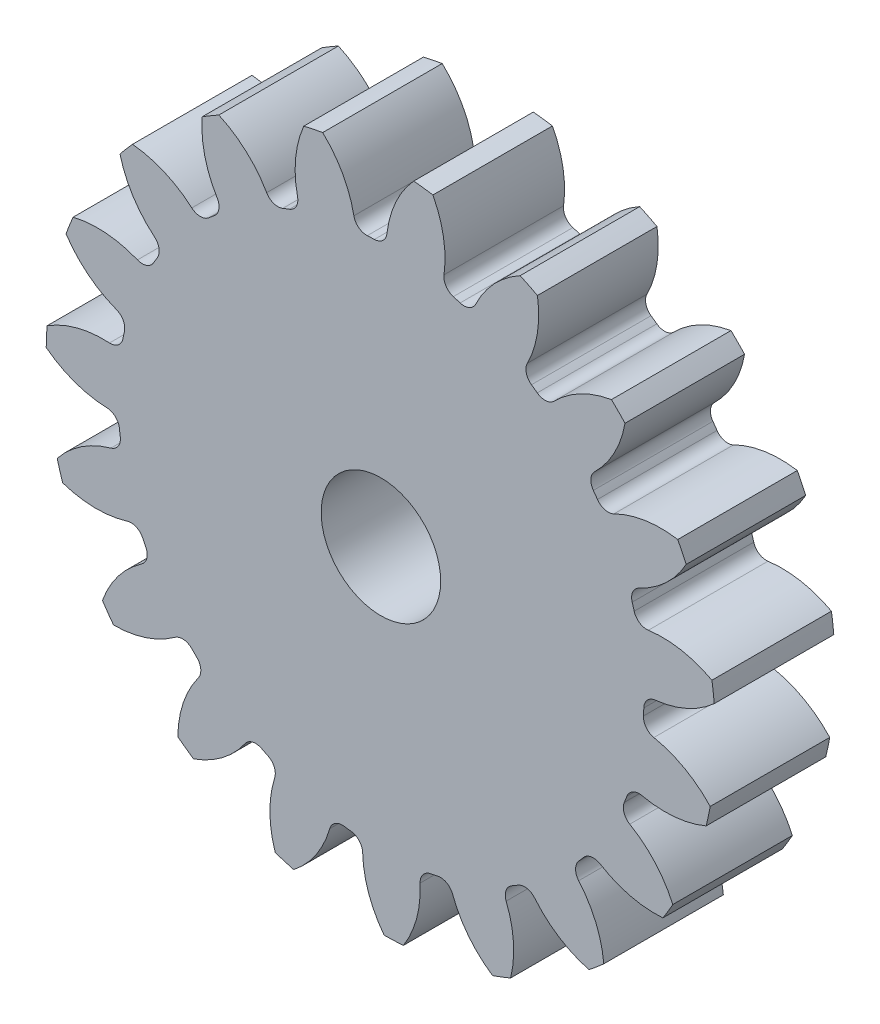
from build123d import *

# Parameters (mm, degrees)
SKETCH3_R         = 355.6
GEARBODY_DEPTH    = 127
TOOTHCUT_DEPTH    = 519.682677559
CIRPATTERN1_COUNT = 19
BOREDIA_R         = 63.5
BORE_DEPTH        = 12700


with BuildPart() as part:
    # Sketch3 → gearBody (new body)
    with BuildSketch(Plane.XY):
        Circle(SKETCH3_R)
    extrude(amount=GEARBODY_DEPTH)

    # Sketch2 → toothCut (cut, through all)
    with BuildSketch(Plane.XY):
        with BuildLine():
            ThreePointArc((278.93165966, -16.170628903), (279.125177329, -12.389325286), (279.267436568, -8.605746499))
            ThreePointArc((279.267436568, -8.605746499), (282.921636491, 0.3247183), (291.536670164, 4.670701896))
            ThreePointArc((291.536670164, 4.670701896), (325.951684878, 14.201404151), (355.6, 34.106301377))
            ThreePointArc((355.6, 34.106301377), (356.880477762, -15.84059299), (351.179841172, -65.477621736))
            ThreePointArc((351.179841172, -65.477621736), (323.411652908, -43.024220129), (289.97637746, -30.481896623))
            ThreePointArc((289.97637746, -30.481896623), (281.780268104, -25.389729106), (278.93165966, -16.170628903))
        make_face()
    toothcut = extrude(amount=TOOTHCUT_DEPTH, mode=Mode.SUBTRACT)

    # CirPattern1: toothCut ×19 about axis
    cirpattern1_axis = Axis((0, 0, 0), (0, 0, 1))
    for i in range(1, CIRPATTERN1_COUNT):
        add(toothcut.rotate(cirpattern1_axis, i * 360 / CIRPATTERN1_COUNT), mode=Mode.SUBTRACT)

    # boreDia → bore (cut, symmetric)
    with BuildSketch(Plane.XY):
        Circle(BOREDIA_R)
    extrude(amount=BORE_DEPTH, both=True, mode=Mode.SUBTRACT)


solid = part.part
